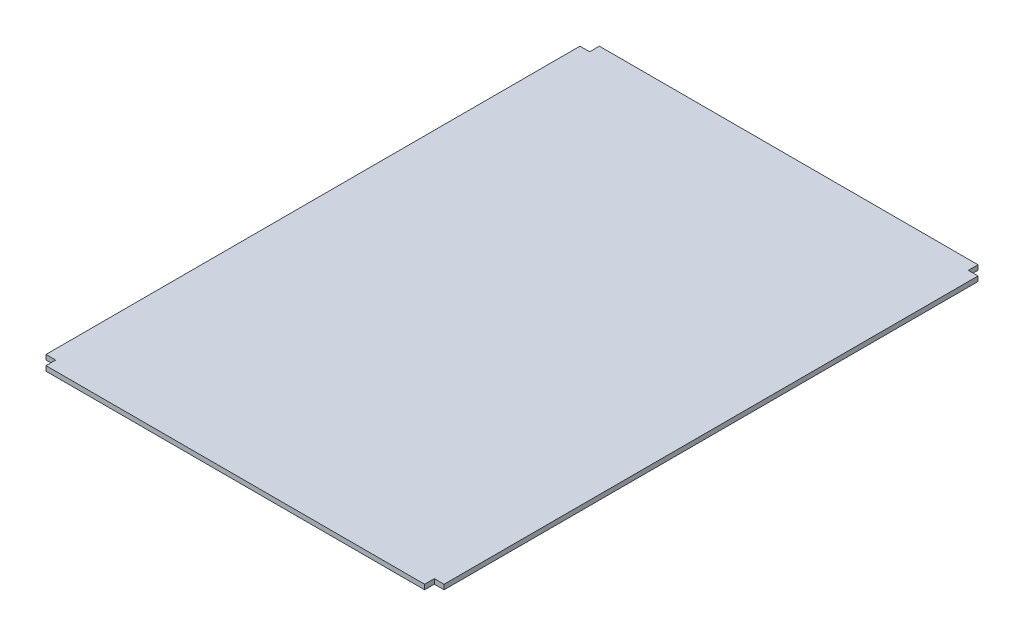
from build123d import *

# Parameters (mm, degrees)
SKETCH1_W           = 520.7
SKETCH1_H           = 723.9
BOSS_EXTRUDE1_DEPTH = 6.35
SKETCH2_W           = 12.7
SKETCH2_H           = 12.7
CUT_EXTRUDE1_DEPTH  = 446.903854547
SKETCH3_W           = 12.7
SKETCH3_H           = 12.7
CUT_EXTRUDE2_DEPTH  = 446.903854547


with BuildPart() as part:
    # Sketch1 → Boss-Extrude1 (new body)
    with BuildSketch(Plane(origin=(0, 0, 0), x_dir=(1, 0, 0), z_dir=(0, 1, 0))):
        Rectangle(SKETCH1_W, SKETCH1_H)
    extrude(amount=BOSS_EXTRUDE1_DEPTH)

    # Sketch2 → Cut-Extrude1 (cut, through all)
    with BuildSketch(Plane(origin=(0, 6.35, 0), x_dir=(1, 0, 0), z_dir=(0, 1, 0))):
        with Locations((-254, -355.6)):
            Rectangle(SKETCH2_W, SKETCH2_H)
    extrude(amount=-CUT_EXTRUDE1_DEPTH, mode=Mode.SUBTRACT)

    # Sketch3 → Cut-Extrude2 (cut, through all)
    with BuildSketch(Plane(origin=(0, 6.35, 0), x_dir=(1, 0, 0), z_dir=(0, 1, 0))):
        with Locations((254, -355.6)):
            Rectangle(SKETCH3_W, SKETCH3_H)
        with Locations((254, 355.6)):
            Rectangle(SKETCH3_W, SKETCH3_H)
        with Locations((-254, 355.6)):
            Rectangle(SKETCH3_W, SKETCH3_H)
    extrude(amount=-CUT_EXTRUDE2_DEPTH, mode=Mode.SUBTRACT)


solid = part.part
